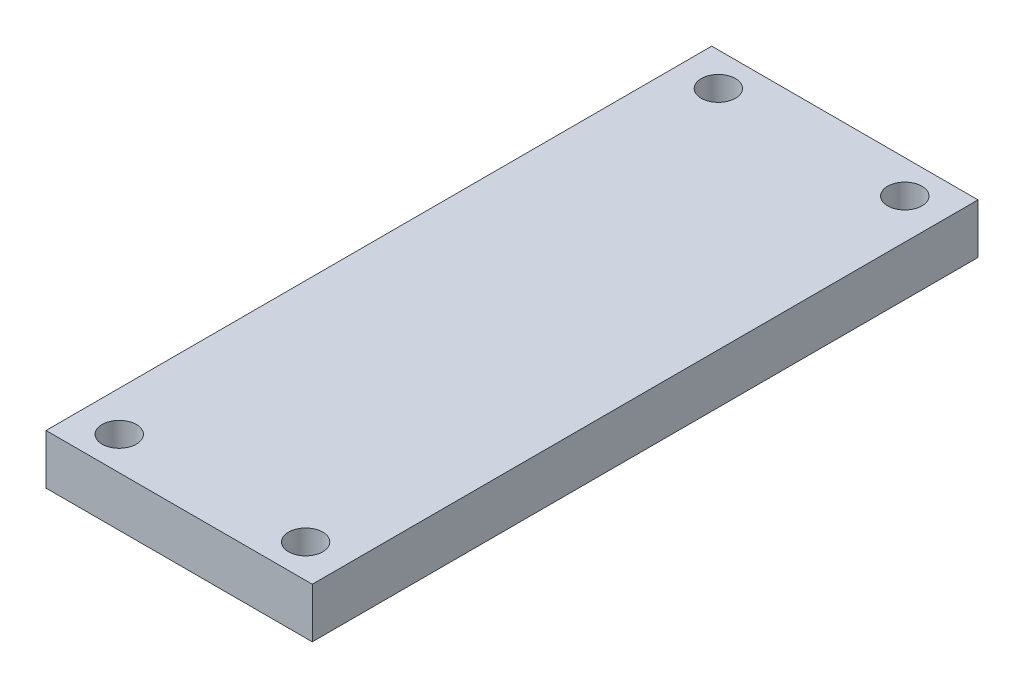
from build123d import *

# Parameters (mm, degrees)
SKETCH1_W             = 25.4
SKETCH1_H             = 63.5
EXTRUDE1_DEPTH        = 4.7625
F_4_CLEARANCE_HOLE1_D = 3.2639


with BuildPart() as part:
    # Sketch1 → Extrude1 (new body)
    with BuildSketch(Plane(origin=(0, 0, 0), x_dir=(1, 0, 0), z_dir=(0, 1, 0))):
        Rectangle(SKETCH1_W, SKETCH1_H)
    extrude(amount=EXTRUDE1_DEPTH)

    # 4 Clearance Hole1 (through all)
    with Locations(Plane(origin=(-8.89, 4.7625, 28.575), x_dir=(0, 0, 1), z_dir=(0, 1, 0))):
        with Locations((0, 0), (0, 17.78), (-57.15, 0), (-57.15, 17.78)):
            Hole(F_4_CLEARANCE_HOLE1_D / 2)


solid = part.part
